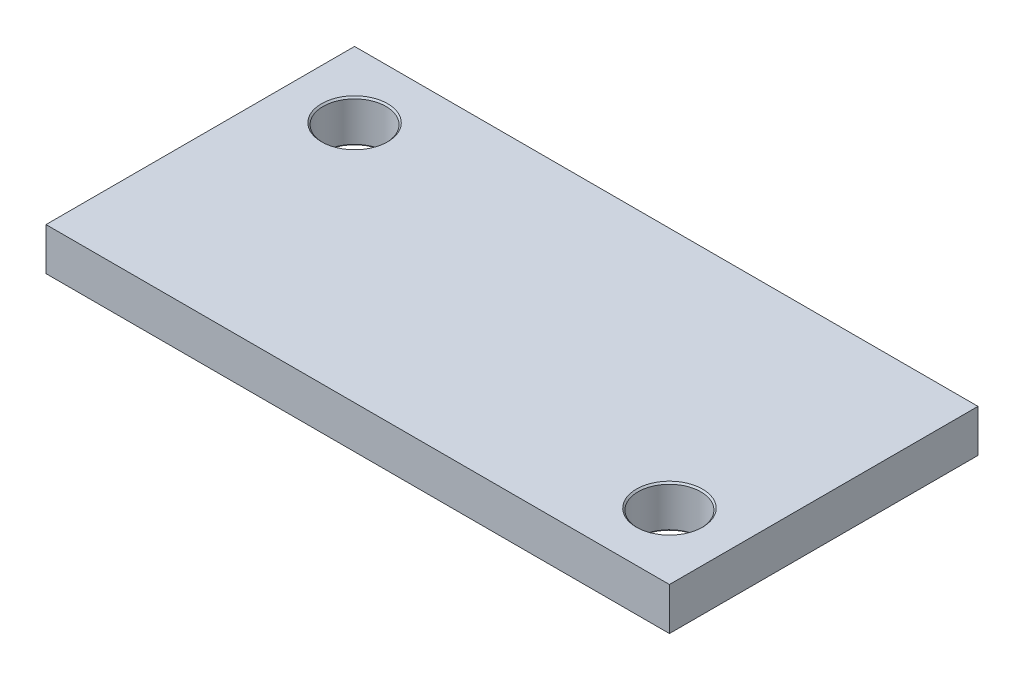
ISO-10303-21;
HEADER;
FILE_DESCRIPTION(('STEP AP214'),'2;1');
FILE_NAME('part.step','',(''),(''),'','','');
FILE_SCHEMA(('AUTOMOTIVE_DESIGN { 1 0 10303 214 1 1 1 1 }'));
ENDSEC;
DATA;
#1=APPLICATION_CONTEXT('core data for automotive mechanical design processes');
#2=APPLICATION_PROTOCOL_DEFINITION('international standard','automotive_design',2000,#1);
#3=PRODUCT_CONTEXT('',#1,'mechanical');
#4=PRODUCT('Part','Part','',(#3));
#5=PRODUCT_RELATED_PRODUCT_CATEGORY('part','',(#4));
#6=PRODUCT_DEFINITION_FORMATION('','',#4);
#7=PRODUCT_DEFINITION_CONTEXT('part definition',#1,'design');
#8=PRODUCT_DEFINITION('design','',#6,#7);
#9=PRODUCT_DEFINITION_SHAPE('','',#8);
#10=(LENGTH_UNIT() NAMED_UNIT(*) SI_UNIT(.MILLI.,.METRE.));
#11=(NAMED_UNIT(*) PLANE_ANGLE_UNIT() SI_UNIT($,.RADIAN.));
#12=(NAMED_UNIT(*) SI_UNIT($,.STERADIAN.) SOLID_ANGLE_UNIT());
#13=UNCERTAINTY_MEASURE_WITH_UNIT(LENGTH_MEASURE(1.E-05),#10,'distance_accuracy_value','');
#14=(GEOMETRIC_REPRESENTATION_CONTEXT(3) GLOBAL_UNCERTAINTY_ASSIGNED_CONTEXT((#13)) GLOBAL_UNIT_ASSIGNED_CONTEXT((#10,
#11,#12)) REPRESENTATION_CONTEXT('',''));
#15=CARTESIAN_POINT('',(0.,0.,0.));
#16=DIRECTION('',(0.,0.,1.));
#17=DIRECTION('',(1.,0.,0.));
#18=AXIS2_PLACEMENT_3D('',#15,#16,#17);
#19=CARTESIAN_POINT('',(0.,27.,0.));
#20=DIRECTION('',(0.,1.,0.));
#21=DIRECTION('',(0.,0.,1.));
#22=AXIS2_PLACEMENT_3D('',#19,#20,#21);
#23=PLANE('',#22);
#24=CARTESIAN_POINT('',(156.,27.,56.));
#25=DIRECTION('',(0.,1.,0.));
#26=DIRECTION('',(0.,0.,1.));
#27=AXIS2_PLACEMENT_3D('',#24,#25,#26);
#28=CIRCLE('',#27,21.);
#29=CARTESIAN_POINT('',(156.,27.,77.));
#30=VERTEX_POINT('',#29);
#31=EDGE_CURVE('E172',#30,#30,#28,.F.);
#32=ORIENTED_EDGE('',*,*,#31,.T.);
#33=EDGE_LOOP('',(#32));
#34=FACE_BOUND('',#33,.T.);
#35=CARTESIAN_POINT('',(-156.,27.,-56.));
#36=DIRECTION('',(0.,1.,0.));
#37=DIRECTION('',(0.,0.,1.));
#38=AXIS2_PLACEMENT_3D('',#35,#36,#37);
#39=CIRCLE('',#38,21.);
#40=CARTESIAN_POINT('',(-156.,27.,-35.));
#41=VERTEX_POINT('',#40);
#42=EDGE_CURVE('E169',#41,#41,#39,.F.);
#43=ORIENTED_EDGE('',*,*,#42,.T.);
#44=EDGE_LOOP('',(#43));
#45=FACE_BOUND('',#44,.T.);
#46=DIRECTION('',(0.,0.,1.));
#47=VECTOR('',#46,1.);
#48=CARTESIAN_POINT('',(-198.,27.,98.));
#49=LINE('',#48,#47);
#50=CARTESIAN_POINT('',(-198.,27.,-98.));
#51=VERTEX_POINT('',#50);
#52=CARTESIAN_POINT('',(-198.,27.,98.));
#53=VERTEX_POINT('',#52);
#54=EDGE_CURVE('E119',#51,#53,#49,.T.);
#55=ORIENTED_EDGE('',*,*,#54,.T.);
#56=DIRECTION('',(1.,0.,0.));
#57=VECTOR('',#56,1.);
#58=CARTESIAN_POINT('',(198.,27.,98.));
#59=LINE('',#58,#57);
#60=CARTESIAN_POINT('',(198.,27.,98.));
#61=VERTEX_POINT('',#60);
#62=EDGE_CURVE('E67',#53,#61,#59,.T.);
#63=ORIENTED_EDGE('',*,*,#62,.T.);
#64=DIRECTION('',(0.,0.,-1.));
#65=VECTOR('',#64,1.);
#66=CARTESIAN_POINT('',(198.,27.,98.));
#67=LINE('',#66,#65);
#68=CARTESIAN_POINT('',(198.,27.,-98.));
#69=VERTEX_POINT('',#68);
#70=EDGE_CURVE('E122',#61,#69,#67,.T.);
#71=ORIENTED_EDGE('',*,*,#70,.T.);
#72=DIRECTION('',(-1.,0.,0.));
#73=VECTOR('',#72,1.);
#74=CARTESIAN_POINT('',(198.,27.,-98.));
#75=LINE('',#74,#73);
#76=EDGE_CURVE('E35',#69,#51,#75,.T.);
#77=ORIENTED_EDGE('',*,*,#76,.T.);
#78=EDGE_LOOP('',(#55,#63,#71,#77));
#79=FACE_BOUND('',#78,.T.);
#80=ADVANCED_FACE('F16',(#34,#45,#79),#23,.T.);
#81=CARTESIAN_POINT('',(0.,0.,0.));
#82=DIRECTION('',(0.,1.,0.));
#83=DIRECTION('',(0.,0.,1.));
#84=AXIS2_PLACEMENT_3D('',#81,#82,#83);
#85=PLANE('',#84);
#86=CARTESIAN_POINT('',(156.,0.,56.));
#87=DIRECTION('',(0.,1.,0.));
#88=DIRECTION('',(0.,0.,1.));
#89=AXIS2_PLACEMENT_3D('',#86,#87,#88);
#90=CIRCLE('',#89,21.);
#91=CARTESIAN_POINT('',(156.,0.,77.));
#92=VERTEX_POINT('',#91);
#93=EDGE_CURVE('E160',#92,#92,#90,.T.);
#94=ORIENTED_EDGE('',*,*,#93,.T.);
#95=EDGE_LOOP('',(#94));
#96=FACE_BOUND('',#95,.T.);
#97=CARTESIAN_POINT('',(-156.,0.,-56.));
#98=DIRECTION('',(0.,1.,0.));
#99=DIRECTION('',(0.,0.,1.));
#100=AXIS2_PLACEMENT_3D('',#97,#98,#99);
#101=CIRCLE('',#100,21.);
#102=CARTESIAN_POINT('',(-156.,0.,-35.));
#103=VERTEX_POINT('',#102);
#104=EDGE_CURVE('E157',#103,#103,#101,.T.);
#105=ORIENTED_EDGE('',*,*,#104,.T.);
#106=EDGE_LOOP('',(#105));
#107=FACE_BOUND('',#106,.T.);
#108=CARTESIAN_POINT('',(181.980762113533,0.,41.));
#109=DIRECTION('',(0.,1.,0.));
#110=DIRECTION('',(0.,0.,1.));
#111=AXIS2_PLACEMENT_3D('',#108,#109,#110);
#112=CIRCLE('',#111,3.49999999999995);
#113=CARTESIAN_POINT('',(181.980762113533,0.,44.5));
#114=VERTEX_POINT('',#113);
#115=EDGE_CURVE('E154',#114,#114,#112,.T.);
#116=ORIENTED_EDGE('',*,*,#115,.T.);
#117=EDGE_LOOP('',(#116));
#118=FACE_BOUND('',#117,.T.);
#119=CARTESIAN_POINT('',(130.019237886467,0.,41.));
#120=DIRECTION('',(0.,1.,0.));
#121=DIRECTION('',(0.,0.,1.));
#122=AXIS2_PLACEMENT_3D('',#119,#120,#121);
#123=CIRCLE('',#122,3.49999999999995);
#124=CARTESIAN_POINT('',(130.019237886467,0.,44.5));
#125=VERTEX_POINT('',#124);
#126=EDGE_CURVE('E151',#125,#125,#123,.T.);
#127=ORIENTED_EDGE('',*,*,#126,.T.);
#128=EDGE_LOOP('',(#127));
#129=FACE_BOUND('',#128,.T.);
#130=CARTESIAN_POINT('',(156.,0.,86.));
#131=DIRECTION('',(0.,1.,0.));
#132=DIRECTION('',(0.,0.,1.));
#133=AXIS2_PLACEMENT_3D('',#130,#131,#132);
#134=CIRCLE('',#133,3.49999999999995);
#135=CARTESIAN_POINT('',(156.,0.,89.4999999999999));
#136=VERTEX_POINT('',#135);
#137=EDGE_CURVE('E148',#136,#136,#134,.T.);
#138=ORIENTED_EDGE('',*,*,#137,.T.);
#139=EDGE_LOOP('',(#138));
#140=FACE_BOUND('',#139,.T.);
#141=CARTESIAN_POINT('',(-130.019237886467,0.,-41.));
#142=DIRECTION('',(0.,1.,0.));
#143=DIRECTION('',(0.,0.,1.));
#144=AXIS2_PLACEMENT_3D('',#141,#142,#143);
#145=CIRCLE('',#144,3.50000000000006);
#146=CARTESIAN_POINT('',(-130.019237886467,0.,-37.4999999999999));
#147=VERTEX_POINT('',#146);
#148=EDGE_CURVE('E145',#147,#147,#145,.T.);
#149=ORIENTED_EDGE('',*,*,#148,.T.);
#150=EDGE_LOOP('',(#149));
#151=FACE_BOUND('',#150,.T.);
#152=CARTESIAN_POINT('',(-156.,0.,-86.));
#153=DIRECTION('',(0.,1.,0.));
#154=DIRECTION('',(0.,0.,1.));
#155=AXIS2_PLACEMENT_3D('',#152,#153,#154);
#156=CIRCLE('',#155,3.49999999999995);
#157=CARTESIAN_POINT('',(-156.,0.,-82.5));
#158=VERTEX_POINT('',#157);
#159=EDGE_CURVE('E142',#158,#158,#156,.T.);
#160=ORIENTED_EDGE('',*,*,#159,.T.);
#161=EDGE_LOOP('',(#160));
#162=FACE_BOUND('',#161,.T.);
#163=CARTESIAN_POINT('',(-181.980762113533,0.,-41.));
#164=DIRECTION('',(0.,1.,0.));
#165=DIRECTION('',(0.,0.,1.));
#166=AXIS2_PLACEMENT_3D('',#163,#164,#165);
#167=CIRCLE('',#166,3.49999999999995);
#168=CARTESIAN_POINT('',(-181.980762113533,0.,-37.5000000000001));
#169=VERTEX_POINT('',#168);
#170=EDGE_CURVE('E139',#169,#169,#167,.T.);
#171=ORIENTED_EDGE('',*,*,#170,.T.);
#172=EDGE_LOOP('',(#171));
#173=FACE_BOUND('',#172,.T.);
#174=DIRECTION('',(0.,0.,1.));
#175=VECTOR('',#174,1.);
#176=CARTESIAN_POINT('',(-198.,0.,98.));
#177=LINE('',#176,#175);
#178=CARTESIAN_POINT('',(-198.,0.,-98.));
#179=VERTEX_POINT('',#178);
#180=CARTESIAN_POINT('',(-198.,0.,98.));
#181=VERTEX_POINT('',#180);
#182=EDGE_CURVE('E118',#179,#181,#177,.T.);
#183=ORIENTED_EDGE('',*,*,#182,.F.);
#184=DIRECTION('',(-1.,0.,0.));
#185=VECTOR('',#184,1.);
#186=CARTESIAN_POINT('',(198.,0.,-98.));
#187=LINE('',#186,#185);
#188=CARTESIAN_POINT('',(198.,0.,-98.));
#189=VERTEX_POINT('',#188);
#190=EDGE_CURVE('E59',#189,#179,#187,.T.);
#191=ORIENTED_EDGE('',*,*,#190,.F.);
#192=DIRECTION('',(0.,0.,-1.));
#193=VECTOR('',#192,1.);
#194=CARTESIAN_POINT('',(198.,0.,98.));
#195=LINE('',#194,#193);
#196=CARTESIAN_POINT('',(198.,0.,98.));
#197=VERTEX_POINT('',#196);
#198=EDGE_CURVE('E53',#197,#189,#195,.T.);
#199=ORIENTED_EDGE('',*,*,#198,.F.);
#200=DIRECTION('',(1.,0.,0.));
#201=VECTOR('',#200,1.);
#202=CARTESIAN_POINT('',(198.,0.,98.));
#203=LINE('',#202,#201);
#204=EDGE_CURVE('E128',#181,#197,#203,.T.);
#205=ORIENTED_EDGE('',*,*,#204,.F.);
#206=EDGE_LOOP('',(#183,#191,#199,#205));
#207=FACE_BOUND('',#206,.T.);
#208=ADVANCED_FACE('F232',(#96,#107,#118,#129,#140,#151,#162,#173,#207),#85,.F.);
#209=CARTESIAN_POINT('',(-198.,27.,98.));
#210=DIRECTION('',(1.,0.,0.));
#211=DIRECTION('',(0.,0.,-1.));
#212=AXIS2_PLACEMENT_3D('',#209,#210,#211);
#213=PLANE('',#212);
#214=ORIENTED_EDGE('',*,*,#182,.T.);
#215=DIRECTION('',(0.,-1.,0.));
#216=VECTOR('',#215,1.);
#217=CARTESIAN_POINT('',(-198.,27.,98.));
#218=LINE('',#217,#216);
#219=EDGE_CURVE('E137',#53,#181,#218,.T.);
#220=ORIENTED_EDGE('',*,*,#219,.F.);
#221=ORIENTED_EDGE('',*,*,#54,.F.);
#222=DIRECTION('',(0.,-1.,0.));
#223=VECTOR('',#222,1.);
#224=CARTESIAN_POINT('',(-198.,27.,-98.));
#225=LINE('',#224,#223);
#226=EDGE_CURVE('E125',#51,#179,#225,.T.);
#227=ORIENTED_EDGE('',*,*,#226,.T.);
#228=EDGE_LOOP('',(#214,#220,#221,#227));
#229=FACE_BOUND('',#228,.T.);
#230=ADVANCED_FACE('F239',(#229),#213,.F.);
#231=CARTESIAN_POINT('',(198.,27.,98.));
#232=DIRECTION('',(0.,0.,-1.));
#233=DIRECTION('',(-1.,0.,0.));
#234=AXIS2_PLACEMENT_3D('',#231,#232,#233);
#235=PLANE('',#234);
#236=ORIENTED_EDGE('',*,*,#204,.T.);
#237=DIRECTION('',(0.,-1.,0.));
#238=VECTOR('',#237,1.);
#239=CARTESIAN_POINT('',(198.,27.,98.));
#240=LINE('',#239,#238);
#241=EDGE_CURVE('E135',#61,#197,#240,.T.);
#242=ORIENTED_EDGE('',*,*,#241,.F.);
#243=ORIENTED_EDGE('',*,*,#62,.F.);
#244=ORIENTED_EDGE('',*,*,#219,.T.);
#245=EDGE_LOOP('',(#236,#242,#243,#244));
#246=FACE_BOUND('',#245,.T.);
#247=ADVANCED_FACE('F253',(#246),#235,.F.);
#248=CARTESIAN_POINT('',(198.,27.,98.));
#249=DIRECTION('',(-1.,0.,0.));
#250=DIRECTION('',(0.,0.,1.));
#251=AXIS2_PLACEMENT_3D('',#248,#249,#250);
#252=PLANE('',#251);
#253=ORIENTED_EDGE('',*,*,#198,.T.);
#254=DIRECTION('',(0.,-1.,0.));
#255=VECTOR('',#254,1.);
#256=CARTESIAN_POINT('',(198.,27.,-98.));
#257=LINE('',#256,#255);
#258=EDGE_CURVE('E133',#69,#189,#257,.T.);
#259=ORIENTED_EDGE('',*,*,#258,.F.);
#260=ORIENTED_EDGE('',*,*,#70,.F.);
#261=ORIENTED_EDGE('',*,*,#241,.T.);
#262=EDGE_LOOP('',(#253,#259,#260,#261));
#263=FACE_BOUND('',#262,.T.);
#264=ADVANCED_FACE('F250',(#263),#252,.F.);
#265=CARTESIAN_POINT('',(198.,27.,-98.));
#266=DIRECTION('',(0.,0.,1.));
#267=DIRECTION('',(1.,0.,0.));
#268=AXIS2_PLACEMENT_3D('',#265,#266,#267);
#269=PLANE('',#268);
#270=ORIENTED_EDGE('',*,*,#190,.T.);
#271=ORIENTED_EDGE('',*,*,#226,.F.);
#272=ORIENTED_EDGE('',*,*,#76,.F.);
#273=ORIENTED_EDGE('',*,*,#258,.T.);
#274=EDGE_LOOP('',(#270,#271,#272,#273));
#275=FACE_BOUND('',#274,.T.);
#276=ADVANCED_FACE('F247',(#275),#269,.F.);
#277=CARTESIAN_POINT('',(-156.,27.,-56.));
#278=DIRECTION('',(0.,-1.,0.));
#279=DIRECTION('',(0.,0.,-1.));
#280=AXIS2_PLACEMENT_3D('',#277,#278,#279);
#281=CYLINDRICAL_SURFACE('',#280,20.);
#282=CARTESIAN_POINT('',(-156.,1.00000000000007,-56.));
#283=DIRECTION('',(0.,1.,0.));
#284=DIRECTION('',(0.,0.,1.));
#285=AXIS2_PLACEMENT_3D('',#282,#283,#284);
#286=CIRCLE('',#285,20.);
#287=CARTESIAN_POINT('',(-156.,1.00000000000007,-36.));
#288=VERTEX_POINT('',#287);
#289=EDGE_CURVE('E10',#288,#288,#286,.F.);
#290=ORIENTED_EDGE('',*,*,#289,.T.);
#291=EDGE_LOOP('',(#290));
#292=FACE_BOUND('',#291,.T.);
#293=CARTESIAN_POINT('',(-156.,26.,-56.));
#294=DIRECTION('',(0.,1.,0.));
#295=DIRECTION('',(0.,0.,1.));
#296=AXIS2_PLACEMENT_3D('',#293,#294,#295);
#297=CIRCLE('',#296,20.);
#298=CARTESIAN_POINT('',(-156.,26.,-36.));
#299=VERTEX_POINT('',#298);
#300=EDGE_CURVE('E26',#299,#299,#297,.T.);
#301=ORIENTED_EDGE('',*,*,#300,.T.);
#302=EDGE_LOOP('',(#301));
#303=FACE_BOUND('',#302,.T.);
#304=ADVANCED_FACE('F244',(#292,#303),#281,.F.);
#305=CARTESIAN_POINT('',(156.,27.,56.));
#306=DIRECTION('',(0.,-1.,0.));
#307=DIRECTION('',(0.,0.,-1.));
#308=AXIS2_PLACEMENT_3D('',#305,#306,#307);
#309=CYLINDRICAL_SURFACE('',#308,20.);
#310=CARTESIAN_POINT('',(156.,1.00000000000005,56.));
#311=DIRECTION('',(0.,1.,0.));
#312=DIRECTION('',(0.,0.,1.));
#313=AXIS2_PLACEMENT_3D('',#310,#311,#312);
#314=CIRCLE('',#313,20.);
#315=CARTESIAN_POINT('',(156.,1.00000000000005,76.));
#316=VERTEX_POINT('',#315);
#317=EDGE_CURVE('E166',#316,#316,#314,.F.);
#318=ORIENTED_EDGE('',*,*,#317,.T.);
#319=EDGE_LOOP('',(#318));
#320=FACE_BOUND('',#319,.T.);
#321=CARTESIAN_POINT('',(156.,26.,56.));
#322=DIRECTION('',(0.,1.,0.));
#323=DIRECTION('',(0.,0.,1.));
#324=AXIS2_PLACEMENT_3D('',#321,#322,#323);
#325=CIRCLE('',#324,20.);
#326=CARTESIAN_POINT('',(156.,26.,76.));
#327=VERTEX_POINT('',#326);
#328=EDGE_CURVE('E163',#327,#327,#325,.T.);
#329=ORIENTED_EDGE('',*,*,#328,.T.);
#330=EDGE_LOOP('',(#329));
#331=FACE_BOUND('',#330,.T.);
#332=ADVANCED_FACE('F263',(#320,#331),#309,.F.);
#333=CARTESIAN_POINT('',(156.,0.,56.));
#334=DIRECTION('',(0.,-1.,0.));
#335=DIRECTION('',(0.,0.,-1.));
#336=AXIS2_PLACEMENT_3D('',#333,#334,#335);
#337=CONICAL_SURFACE('',#336,21.,0.785398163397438);
#338=ORIENTED_EDGE('',*,*,#317,.F.);
#339=EDGE_LOOP('',(#338));
#340=FACE_BOUND('',#339,.T.);
#341=ORIENTED_EDGE('',*,*,#93,.F.);
#342=EDGE_LOOP('',(#341));
#343=FACE_BOUND('',#342,.T.);
#344=ADVANCED_FACE('F259',(#340,#343),#337,.F.);
#345=CARTESIAN_POINT('',(156.,26.,56.));
#346=DIRECTION('',(0.,1.,0.));
#347=DIRECTION('',(0.,0.,1.));
#348=AXIS2_PLACEMENT_3D('',#345,#346,#347);
#349=CONICAL_SURFACE('',#348,20.,0.785398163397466);
#350=ORIENTED_EDGE('',*,*,#31,.F.);
#351=EDGE_LOOP('',(#350));
#352=FACE_BOUND('',#351,.T.);
#353=ORIENTED_EDGE('',*,*,#328,.F.);
#354=EDGE_LOOP('',(#353));
#355=FACE_BOUND('',#354,.T.);
#356=ADVANCED_FACE('F262',(#352,#355),#349,.F.);
#357=CARTESIAN_POINT('',(-156.,0.,-56.));
#358=DIRECTION('',(0.,-1.,0.));
#359=DIRECTION('',(0.,0.,-1.));
#360=AXIS2_PLACEMENT_3D('',#357,#358,#359);
#361=CONICAL_SURFACE('',#360,21.,0.785398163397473);
#362=ORIENTED_EDGE('',*,*,#289,.F.);
#363=EDGE_LOOP('',(#362));
#364=FACE_BOUND('',#363,.T.);
#365=ORIENTED_EDGE('',*,*,#104,.F.);
#366=EDGE_LOOP('',(#365));
#367=FACE_BOUND('',#366,.T.);
#368=ADVANCED_FACE('F267',(#364,#367),#361,.F.);
#369=CARTESIAN_POINT('',(-156.,26.,-56.));
#370=DIRECTION('',(0.,1.,0.));
#371=DIRECTION('',(0.,0.,1.));
#372=AXIS2_PLACEMENT_3D('',#369,#370,#371);
#373=CONICAL_SURFACE('',#372,20.,0.785398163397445);
#374=ORIENTED_EDGE('',*,*,#42,.F.);
#375=EDGE_LOOP('',(#374));
#376=FACE_BOUND('',#375,.T.);
#377=ORIENTED_EDGE('',*,*,#300,.F.);
#378=EDGE_LOOP('',(#377));
#379=FACE_BOUND('',#378,.T.);
#380=ADVANCED_FACE('F271',(#376,#379),#373,.F.);
#381=CARTESIAN_POINT('',(181.980762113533,1.00000000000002,41.));
#382=DIRECTION('',(0.,-1.,0.));
#383=DIRECTION('',(0.,0.,-1.));
#384=AXIS2_PLACEMENT_3D('',#381,#382,#383);
#385=CONICAL_SURFACE('',#384,2.5,0.785398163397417);
#386=CARTESIAN_POINT('',(181.980762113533,0.499999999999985,41.));
#387=DIRECTION('',(0.,-1.,0.));
#388=DIRECTION('',(0.,0.,-1.));
#389=AXIS2_PLACEMENT_3D('',#386,#387,#388);
#390=CIRCLE('',#389,3.);
#391=CARTESIAN_POINT('',(181.980762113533,0.499999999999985,38.));
#392=VERTEX_POINT('',#391);
#393=EDGE_CURVE('E192',#392,#392,#390,.T.);
#394=ORIENTED_EDGE('',*,*,#393,.F.);
#395=EDGE_LOOP('',(#394));
#396=FACE_BOUND('',#395,.T.);
#397=ORIENTED_EDGE('',*,*,#115,.F.);
#398=EDGE_LOOP('',(#397));
#399=FACE_BOUND('',#398,.T.);
#400=ADVANCED_FACE('F275',(#396,#399),#385,.F.);
#401=CARTESIAN_POINT('',(130.019237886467,1.00000000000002,41.));
#402=DIRECTION('',(0.,-1.,0.));
#403=DIRECTION('',(0.,0.,-1.));
#404=AXIS2_PLACEMENT_3D('',#401,#402,#403);
#405=CONICAL_SURFACE('',#404,2.5,0.785398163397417);
#406=CARTESIAN_POINT('',(130.019237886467,0.499999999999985,41.));
#407=DIRECTION('',(0.,-1.,0.));
#408=DIRECTION('',(0.,0.,-1.));
#409=AXIS2_PLACEMENT_3D('',#406,#407,#408);
#410=CIRCLE('',#409,3.);
#411=CARTESIAN_POINT('',(130.019237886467,0.499999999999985,38.));
#412=VERTEX_POINT('',#411);
#413=EDGE_CURVE('E189',#412,#412,#410,.T.);
#414=ORIENTED_EDGE('',*,*,#413,.F.);
#415=EDGE_LOOP('',(#414));
#416=FACE_BOUND('',#415,.T.);
#417=ORIENTED_EDGE('',*,*,#126,.F.);
#418=EDGE_LOOP('',(#417));
#419=FACE_BOUND('',#418,.T.);
#420=ADVANCED_FACE('F279',(#416,#419),#405,.F.);
#421=CARTESIAN_POINT('',(156.,1.00000000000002,86.));
#422=DIRECTION('',(0.,-1.,0.));
#423=DIRECTION('',(0.,0.,-1.));
#424=AXIS2_PLACEMENT_3D('',#421,#422,#423);
#425=CONICAL_SURFACE('',#424,2.5,0.785398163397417);
#426=CARTESIAN_POINT('',(156.,0.499999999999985,86.));
#427=DIRECTION('',(0.,-1.,0.));
#428=DIRECTION('',(0.,0.,-1.));
#429=AXIS2_PLACEMENT_3D('',#426,#427,#428);
#430=CIRCLE('',#429,3.);
#431=CARTESIAN_POINT('',(156.,0.499999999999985,83.));
#432=VERTEX_POINT('',#431);
#433=EDGE_CURVE('E186',#432,#432,#430,.T.);
#434=ORIENTED_EDGE('',*,*,#433,.F.);
#435=EDGE_LOOP('',(#434));
#436=FACE_BOUND('',#435,.T.);
#437=ORIENTED_EDGE('',*,*,#137,.F.);
#438=EDGE_LOOP('',(#437));
#439=FACE_BOUND('',#438,.T.);
#440=ADVANCED_FACE('F283',(#436,#439),#425,.F.);
#441=CARTESIAN_POINT('',(-130.019237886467,1.00000000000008,-41.));
#442=DIRECTION('',(0.,-1.,0.));
#443=DIRECTION('',(0.,0.,-1.));
#444=AXIS2_PLACEMENT_3D('',#441,#442,#443);
#445=CONICAL_SURFACE('',#444,2.5,0.785398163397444);
#446=CARTESIAN_POINT('',(-130.019237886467,0.500000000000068,-41.));
#447=DIRECTION('',(0.,-1.,0.));
#448=DIRECTION('',(0.,0.,-1.));
#449=AXIS2_PLACEMENT_3D('',#446,#447,#448);
#450=CIRCLE('',#449,3.);
#451=CARTESIAN_POINT('',(-130.019237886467,0.500000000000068,-44.));
#452=VERTEX_POINT('',#451);
#453=EDGE_CURVE('E183',#452,#452,#450,.T.);
#454=ORIENTED_EDGE('',*,*,#453,.F.);
#455=EDGE_LOOP('',(#454));
#456=FACE_BOUND('',#455,.T.);
#457=ORIENTED_EDGE('',*,*,#148,.F.);
#458=EDGE_LOOP('',(#457));
#459=FACE_BOUND('',#458,.T.);
#460=ADVANCED_FACE('F287',(#456,#459),#445,.F.);
#461=CARTESIAN_POINT('',(-156.,1.00000000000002,-86.));
#462=DIRECTION('',(0.,-1.,0.));
#463=DIRECTION('',(0.,0.,-1.));
#464=AXIS2_PLACEMENT_3D('',#461,#462,#463);
#465=CONICAL_SURFACE('',#464,2.5,0.785398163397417);
#466=CARTESIAN_POINT('',(-156.,0.499999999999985,-86.));
#467=DIRECTION('',(0.,-1.,0.));
#468=DIRECTION('',(0.,0.,-1.));
#469=AXIS2_PLACEMENT_3D('',#466,#467,#468);
#470=CIRCLE('',#469,3.);
#471=CARTESIAN_POINT('',(-156.,0.499999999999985,-89.));
#472=VERTEX_POINT('',#471);
#473=EDGE_CURVE('E180',#472,#472,#470,.T.);
#474=ORIENTED_EDGE('',*,*,#473,.F.);
#475=EDGE_LOOP('',(#474));
#476=FACE_BOUND('',#475,.T.);
#477=ORIENTED_EDGE('',*,*,#159,.F.);
#478=EDGE_LOOP('',(#477));
#479=FACE_BOUND('',#478,.T.);
#480=ADVANCED_FACE('F290',(#476,#479),#465,.F.);
#481=CARTESIAN_POINT('',(-181.980762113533,1.00000000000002,-41.));
#482=DIRECTION('',(0.,-1.,0.));
#483=DIRECTION('',(0.,0.,-1.));
#484=AXIS2_PLACEMENT_3D('',#481,#482,#483);
#485=CONICAL_SURFACE('',#484,2.5,0.785398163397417);
#486=CARTESIAN_POINT('',(-181.980762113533,0.499999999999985,-41.));
#487=DIRECTION('',(0.,-1.,0.));
#488=DIRECTION('',(0.,0.,-1.));
#489=AXIS2_PLACEMENT_3D('',#486,#487,#488);
#490=CIRCLE('',#489,3.);
#491=CARTESIAN_POINT('',(-181.980762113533,0.499999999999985,-44.));
#492=VERTEX_POINT('',#491);
#493=EDGE_CURVE('E177',#492,#492,#490,.T.);
#494=ORIENTED_EDGE('',*,*,#493,.F.);
#495=EDGE_LOOP('',(#494));
#496=FACE_BOUND('',#495,.T.);
#497=ORIENTED_EDGE('',*,*,#170,.F.);
#498=EDGE_LOOP('',(#497));
#499=FACE_BOUND('',#498,.T.);
#500=ADVANCED_FACE('F18',(#496,#499),#485,.F.);
#501=CARTESIAN_POINT('',(-181.980762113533,15.,-41.));
#502=DIRECTION('',(0.,-1.,0.));
#503=DIRECTION('',(0.,0.,-1.));
#504=AXIS2_PLACEMENT_3D('',#501,#502,#503);
#505=PLANE('',#504);
#506=CARTESIAN_POINT('',(-181.980762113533,15.,-41.));
#507=DIRECTION('',(0.,-1.,0.));
#508=DIRECTION('',(0.,0.,-1.));
#509=AXIS2_PLACEMENT_3D('',#506,#507,#508);
#510=CIRCLE('',#509,3.);
#511=CARTESIAN_POINT('',(-181.980762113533,15.,-44.));
#512=VERTEX_POINT('',#511);
#513=EDGE_CURVE('E330',#512,#512,#510,.T.);
#514=ORIENTED_EDGE('',*,*,#513,.T.);
#515=EDGE_LOOP('',(#514));
#516=FACE_BOUND('',#515,.T.);
#517=CARTESIAN_POINT('',(-181.980762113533,15.,-41.));
#518=DIRECTION('',(0.,-1.,0.));
#519=DIRECTION('',(0.,0.,-1.));
#520=AXIS2_PLACEMENT_3D('',#517,#518,#519);
#521=CIRCLE('',#520,2.5);
#522=CARTESIAN_POINT('',(-181.980762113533,15.,-43.5));
#523=VERTEX_POINT('',#522);
#524=EDGE_CURVE('E195',#523,#523,#521,.F.);
#525=ORIENTED_EDGE('',*,*,#524,.T.);
#526=EDGE_LOOP('',(#525));
#527=FACE_BOUND('',#526,.T.);
#528=ADVANCED_FACE('F298',(#516,#527),#505,.T.);
#529=CARTESIAN_POINT('',(-181.980762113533,15.,-41.));
#530=DIRECTION('',(0.,-1.,0.));
#531=DIRECTION('',(0.,0.,-1.));
#532=AXIS2_PLACEMENT_3D('',#529,#530,#531);
#533=CYLINDRICAL_SURFACE('',#532,3.);
#534=ORIENTED_EDGE('',*,*,#493,.T.);
#535=EDGE_LOOP('',(#534));
#536=FACE_BOUND('',#535,.T.);
#537=ORIENTED_EDGE('',*,*,#513,.F.);
#538=EDGE_LOOP('',(#537));
#539=FACE_BOUND('',#538,.T.);
#540=ADVANCED_FACE('F338',(#536,#539),#533,.F.);
#541=CARTESIAN_POINT('',(-156.,15.,-86.));
#542=DIRECTION('',(0.,-1.,0.));
#543=DIRECTION('',(0.,0.,-1.));
#544=AXIS2_PLACEMENT_3D('',#541,#542,#543);
#545=PLANE('',#544);
#546=CARTESIAN_POINT('',(-156.,15.,-86.));
#547=DIRECTION('',(0.,-1.,0.));
#548=DIRECTION('',(0.,0.,-1.));
#549=AXIS2_PLACEMENT_3D('',#546,#547,#548);
#550=CIRCLE('',#549,3.);
#551=CARTESIAN_POINT('',(-156.,15.,-89.));
#552=VERTEX_POINT('',#551);
#553=EDGE_CURVE('E321',#552,#552,#550,.T.);
#554=ORIENTED_EDGE('',*,*,#553,.T.);
#555=EDGE_LOOP('',(#554));
#556=FACE_BOUND('',#555,.T.);
#557=CARTESIAN_POINT('',(-156.,15.,-86.));
#558=DIRECTION('',(0.,-1.,0.));
#559=DIRECTION('',(0.,0.,-1.));
#560=AXIS2_PLACEMENT_3D('',#557,#558,#559);
#561=CIRCLE('',#560,2.5);
#562=CARTESIAN_POINT('',(-156.,15.,-88.5));
#563=VERTEX_POINT('',#562);
#564=EDGE_CURVE('E201',#563,#563,#561,.F.);
#565=ORIENTED_EDGE('',*,*,#564,.T.);
#566=EDGE_LOOP('',(#565));
#567=FACE_BOUND('',#566,.T.);
#568=ADVANCED_FACE('F317',(#556,#567),#545,.T.);
#569=CARTESIAN_POINT('',(-156.,15.,-86.));
#570=DIRECTION('',(0.,-1.,0.));
#571=DIRECTION('',(0.,0.,-1.));
#572=AXIS2_PLACEMENT_3D('',#569,#570,#571);
#573=CYLINDRICAL_SURFACE('',#572,3.);
#574=ORIENTED_EDGE('',*,*,#473,.T.);
#575=EDGE_LOOP('',(#574));
#576=FACE_BOUND('',#575,.T.);
#577=ORIENTED_EDGE('',*,*,#553,.F.);
#578=EDGE_LOOP('',(#577));
#579=FACE_BOUND('',#578,.T.);
#580=ADVANCED_FACE('F313',(#576,#579),#573,.F.);
#581=CARTESIAN_POINT('',(-130.019237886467,15.,-41.));
#582=DIRECTION('',(0.,-1.,0.));
#583=DIRECTION('',(0.,0.,-1.));
#584=AXIS2_PLACEMENT_3D('',#581,#582,#583);
#585=PLANE('',#584);
#586=CARTESIAN_POINT('',(-130.019237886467,15.,-41.));
#587=DIRECTION('',(0.,-1.,0.));
#588=DIRECTION('',(0.,0.,-1.));
#589=AXIS2_PLACEMENT_3D('',#586,#587,#588);
#590=CIRCLE('',#589,3.);
#591=CARTESIAN_POINT('',(-130.019237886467,15.,-44.));
#592=VERTEX_POINT('',#591);
#593=EDGE_CURVE('E324',#592,#592,#590,.T.);
#594=ORIENTED_EDGE('',*,*,#593,.T.);
#595=EDGE_LOOP('',(#594));
#596=FACE_BOUND('',#595,.T.);
#597=CARTESIAN_POINT('',(-130.019237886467,15.,-41.));
#598=DIRECTION('',(0.,-1.,0.));
#599=DIRECTION('',(0.,0.,-1.));
#600=AXIS2_PLACEMENT_3D('',#597,#598,#599);
#601=CIRCLE('',#600,2.5);
#602=CARTESIAN_POINT('',(-130.019237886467,15.,-43.5));
#603=VERTEX_POINT('',#602);
#604=EDGE_CURVE('E198',#603,#603,#601,.F.);
#605=ORIENTED_EDGE('',*,*,#604,.T.);
#606=EDGE_LOOP('',(#605));
#607=FACE_BOUND('',#606,.T.);
#608=ADVANCED_FACE('F316',(#596,#607),#585,.T.);
#609=CARTESIAN_POINT('',(-130.019237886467,15.,-41.));
#610=DIRECTION('',(0.,-1.,0.));
#611=DIRECTION('',(0.,0.,-1.));
#612=AXIS2_PLACEMENT_3D('',#609,#610,#611);
#613=CYLINDRICAL_SURFACE('',#612,3.);
#614=ORIENTED_EDGE('',*,*,#453,.T.);
#615=EDGE_LOOP('',(#614));
#616=FACE_BOUND('',#615,.T.);
#617=ORIENTED_EDGE('',*,*,#593,.F.);
#618=EDGE_LOOP('',(#617));
#619=FACE_BOUND('',#618,.T.);
#620=ADVANCED_FACE('F615',(#616,#619),#613,.F.);
#621=CARTESIAN_POINT('',(156.,15.,86.));
#622=DIRECTION('',(0.,-1.,0.));
#623=DIRECTION('',(0.,0.,-1.));
#624=AXIS2_PLACEMENT_3D('',#621,#622,#623);
#625=PLANE('',#624);
#626=CARTESIAN_POINT('',(156.,15.,86.));
#627=DIRECTION('',(0.,-1.,0.));
#628=DIRECTION('',(0.,0.,-1.));
#629=AXIS2_PLACEMENT_3D('',#626,#627,#628);
#630=CIRCLE('',#629,3.);
#631=CARTESIAN_POINT('',(156.,15.,83.));
#632=VERTEX_POINT('',#631);
#633=EDGE_CURVE('E323',#632,#632,#630,.T.);
#634=ORIENTED_EDGE('',*,*,#633,.T.);
#635=EDGE_LOOP('',(#634));
#636=FACE_BOUND('',#635,.T.);
#637=CARTESIAN_POINT('',(156.,15.,86.));
#638=DIRECTION('',(0.,-1.,0.));
#639=DIRECTION('',(0.,0.,-1.));
#640=AXIS2_PLACEMENT_3D('',#637,#638,#639);
#641=CIRCLE('',#640,2.5);
#642=CARTESIAN_POINT('',(156.,15.,83.5));
#643=VERTEX_POINT('',#642);
#644=EDGE_CURVE('E20',#643,#643,#641,.F.);
#645=ORIENTED_EDGE('',*,*,#644,.T.);
#646=EDGE_LOOP('',(#645));
#647=FACE_BOUND('',#646,.T.);
#648=ADVANCED_FACE('F605',(#636,#647),#625,.T.);
#649=CARTESIAN_POINT('',(156.,15.,86.));
#650=DIRECTION('',(0.,-1.,0.));
#651=DIRECTION('',(0.,0.,-1.));
#652=AXIS2_PLACEMENT_3D('',#649,#650,#651);
#653=CYLINDRICAL_SURFACE('',#652,3.);
#654=ORIENTED_EDGE('',*,*,#433,.T.);
#655=EDGE_LOOP('',(#654));
#656=FACE_BOUND('',#655,.T.);
#657=ORIENTED_EDGE('',*,*,#633,.F.);
#658=EDGE_LOOP('',(#657));
#659=FACE_BOUND('',#658,.T.);
#660=ADVANCED_FACE('F355',(#656,#659),#653,.F.);
#661=CARTESIAN_POINT('',(130.019237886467,15.,41.));
#662=DIRECTION('',(0.,-1.,0.));
#663=DIRECTION('',(0.,0.,-1.));
#664=AXIS2_PLACEMENT_3D('',#661,#662,#663);
#665=PLANE('',#664);
#666=CARTESIAN_POINT('',(130.019237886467,15.,41.));
#667=DIRECTION('',(0.,-1.,0.));
#668=DIRECTION('',(0.,0.,-1.));
#669=AXIS2_PLACEMENT_3D('',#666,#667,#668);
#670=CIRCLE('',#669,3.);
#671=CARTESIAN_POINT('',(130.019237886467,15.,38.));
#672=VERTEX_POINT('',#671);
#673=EDGE_CURVE('E104',#672,#672,#670,.T.);
#674=ORIENTED_EDGE('',*,*,#673,.T.);
#675=EDGE_LOOP('',(#674));
#676=FACE_BOUND('',#675,.T.);
#677=CARTESIAN_POINT('',(130.019237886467,15.,41.));
#678=DIRECTION('',(0.,-1.,0.));
#679=DIRECTION('',(0.,0.,-1.));
#680=AXIS2_PLACEMENT_3D('',#677,#678,#679);
#681=CIRCLE('',#680,2.5);
#682=CARTESIAN_POINT('',(130.019237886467,15.,38.5));
#683=VERTEX_POINT('',#682);
#684=EDGE_CURVE('E204',#683,#683,#681,.F.);
#685=ORIENTED_EDGE('',*,*,#684,.T.);
#686=EDGE_LOOP('',(#685));
#687=FACE_BOUND('',#686,.T.);
#688=ADVANCED_FACE('F351',(#676,#687),#665,.T.);
#689=CARTESIAN_POINT('',(130.019237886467,15.,41.));
#690=DIRECTION('',(0.,-1.,0.));
#691=DIRECTION('',(0.,0.,-1.));
#692=AXIS2_PLACEMENT_3D('',#689,#690,#691);
#693=CYLINDRICAL_SURFACE('',#692,3.);
#694=ORIENTED_EDGE('',*,*,#413,.T.);
#695=EDGE_LOOP('',(#694));
#696=FACE_BOUND('',#695,.T.);
#697=ORIENTED_EDGE('',*,*,#673,.F.);
#698=EDGE_LOOP('',(#697));
#699=FACE_BOUND('',#698,.T.);
#700=ADVANCED_FACE('F354',(#696,#699),#693,.F.);
#701=CARTESIAN_POINT('',(181.980762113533,15.,41.));
#702=DIRECTION('',(0.,-1.,0.));
#703=DIRECTION('',(0.,0.,-1.));
#704=AXIS2_PLACEMENT_3D('',#701,#702,#703);
#705=PLANE('',#704);
#706=CARTESIAN_POINT('',(181.980762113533,15.,41.));
#707=DIRECTION('',(0.,-1.,0.));
#708=DIRECTION('',(0.,0.,-1.));
#709=AXIS2_PLACEMENT_3D('',#706,#707,#708);
#710=CIRCLE('',#709,3.);
#711=CARTESIAN_POINT('',(181.980762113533,15.,38.));
#712=VERTEX_POINT('',#711);
#713=EDGE_CURVE('E327',#712,#712,#710,.T.);
#714=ORIENTED_EDGE('',*,*,#713,.T.);
#715=EDGE_LOOP('',(#714));
#716=FACE_BOUND('',#715,.T.);
#717=CARTESIAN_POINT('',(181.980762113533,15.,41.));
#718=DIRECTION('',(0.,-1.,0.));
#719=DIRECTION('',(0.,0.,-1.));
#720=AXIS2_PLACEMENT_3D('',#717,#718,#719);
#721=CIRCLE('',#720,2.5);
#722=CARTESIAN_POINT('',(181.980762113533,15.,38.5));
#723=VERTEX_POINT('',#722);
#724=EDGE_CURVE('E102',#723,#723,#721,.F.);
#725=ORIENTED_EDGE('',*,*,#724,.T.);
#726=EDGE_LOOP('',(#725));
#727=FACE_BOUND('',#726,.T.);
#728=ADVANCED_FACE('F209',(#716,#727),#705,.T.);
#729=CARTESIAN_POINT('',(181.980762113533,15.,41.));
#730=DIRECTION('',(0.,-1.,0.));
#731=DIRECTION('',(0.,0.,-1.));
#732=AXIS2_PLACEMENT_3D('',#729,#730,#731);
#733=CYLINDRICAL_SURFACE('',#732,3.);
#734=ORIENTED_EDGE('',*,*,#393,.T.);
#735=EDGE_LOOP('',(#734));
#736=FACE_BOUND('',#735,.T.);
#737=ORIENTED_EDGE('',*,*,#713,.F.);
#738=EDGE_LOOP('',(#737));
#739=FACE_BOUND('',#738,.T.);
#740=ADVANCED_FACE('F90',(#736,#739),#733,.F.);
#741=CARTESIAN_POINT('',(-181.980762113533,18.,-41.));
#742=DIRECTION('',(0.,-1.,0.));
#743=DIRECTION('',(0.,0.,-1.));
#744=AXIS2_PLACEMENT_3D('',#741,#742,#743);
#745=CONICAL_SURFACE('',#744,2.49999999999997,1.02974425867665);
#746=CARTESIAN_POINT('',(-181.980762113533,19.5021515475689,-41.));
#747=VERTEX_POINT('',#746);
#748=VERTEX_LOOP('',#747);
#749=FACE_BOUND('',#748,.T.);
#750=CARTESIAN_POINT('',(-181.980762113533,18.,-41.));
#751=DIRECTION('',(0.,-1.,0.));
#752=DIRECTION('',(0.,0.,-1.));
#753=AXIS2_PLACEMENT_3D('',#750,#751,#752);
#754=CIRCLE('',#753,2.49999999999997);
#755=CARTESIAN_POINT('',(-181.980762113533,18.,-43.5));
#756=VERTEX_POINT('',#755);
#757=EDGE_CURVE('E94',#756,#756,#754,.T.);
#758=ORIENTED_EDGE('',*,*,#757,.T.);
#759=EDGE_LOOP('',(#758));
#760=FACE_BOUND('',#759,.T.);
#761=ADVANCED_FACE('F86',(#749,#760),#745,.F.);
#762=CARTESIAN_POINT('',(-181.980762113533,0.,-41.));
#763=DIRECTION('',(0.,-1.,0.));
#764=DIRECTION('',(0.,0.,-1.));
#765=AXIS2_PLACEMENT_3D('',#762,#763,#764);
#766=CYLINDRICAL_SURFACE('',#765,2.5);
#767=ORIENTED_EDGE('',*,*,#757,.F.);
#768=EDGE_LOOP('',(#767));
#769=FACE_BOUND('',#768,.T.);
#770=ORIENTED_EDGE('',*,*,#524,.F.);
#771=EDGE_LOOP('',(#770));
#772=FACE_BOUND('',#771,.T.);
#773=ADVANCED_FACE('F89',(#769,#772),#766,.F.);
#774=CARTESIAN_POINT('',(-130.019237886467,18.,-41.));
#775=DIRECTION('',(0.,-1.,0.));
#776=DIRECTION('',(0.,0.,-1.));
#777=AXIS2_PLACEMENT_3D('',#774,#775,#776);
#778=CONICAL_SURFACE('',#777,2.49999999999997,1.02974425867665);
#779=CARTESIAN_POINT('',(-130.019237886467,19.5021515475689,-41.));
#780=VERTEX_POINT('',#779);
#781=VERTEX_LOOP('',#780);
#782=FACE_BOUND('',#781,.T.);
#783=CARTESIAN_POINT('',(-130.019237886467,18.,-41.));
#784=DIRECTION('',(0.,-1.,0.));
#785=DIRECTION('',(0.,0.,-1.));
#786=AXIS2_PLACEMENT_3D('',#783,#784,#785);
#787=CIRCLE('',#786,2.49999999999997);
#788=CARTESIAN_POINT('',(-130.019237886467,18.,-43.5));
#789=VERTEX_POINT('',#788);
#790=EDGE_CURVE('E96',#789,#789,#787,.T.);
#791=ORIENTED_EDGE('',*,*,#790,.T.);
#792=EDGE_LOOP('',(#791));
#793=FACE_BOUND('',#792,.T.);
#794=ADVANCED_FACE('F361',(#782,#793),#778,.F.);
#795=CARTESIAN_POINT('',(-130.019237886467,0.,-41.));
#796=DIRECTION('',(0.,-1.,0.));
#797=DIRECTION('',(0.,0.,-1.));
#798=AXIS2_PLACEMENT_3D('',#795,#796,#797);
#799=CYLINDRICAL_SURFACE('',#798,2.5);
#800=ORIENTED_EDGE('',*,*,#790,.F.);
#801=EDGE_LOOP('',(#800));
#802=FACE_BOUND('',#801,.T.);
#803=ORIENTED_EDGE('',*,*,#604,.F.);
#804=EDGE_LOOP('',(#803));
#805=FACE_BOUND('',#804,.T.);
#806=ADVANCED_FACE('F363',(#802,#805),#799,.F.);
#807=CARTESIAN_POINT('',(-156.,18.,-86.));
#808=DIRECTION('',(0.,-1.,0.));
#809=DIRECTION('',(0.,0.,-1.));
#810=AXIS2_PLACEMENT_3D('',#807,#808,#809);
#811=CONICAL_SURFACE('',#810,2.49999999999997,1.02974425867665);
#812=CARTESIAN_POINT('',(-156.,19.5021515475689,-86.));
#813=VERTEX_POINT('',#812);
#814=VERTEX_LOOP('',#813);
#815=FACE_BOUND('',#814,.T.);
#816=CARTESIAN_POINT('',(-156.,18.,-86.));
#817=DIRECTION('',(0.,-1.,0.));
#818=DIRECTION('',(0.,0.,-1.));
#819=AXIS2_PLACEMENT_3D('',#816,#817,#818);
#820=CIRCLE('',#819,2.49999999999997);
#821=CARTESIAN_POINT('',(-156.,18.,-88.5));
#822=VERTEX_POINT('',#821);
#823=EDGE_CURVE('E99',#822,#822,#820,.T.);
#824=ORIENTED_EDGE('',*,*,#823,.T.);
#825=EDGE_LOOP('',(#824));
#826=FACE_BOUND('',#825,.T.);
#827=ADVANCED_FACE('F366',(#815,#826),#811,.F.);
#828=CARTESIAN_POINT('',(-156.,0.,-86.));
#829=DIRECTION('',(0.,-1.,0.));
#830=DIRECTION('',(0.,0.,-1.));
#831=AXIS2_PLACEMENT_3D('',#828,#829,#830);
#832=CYLINDRICAL_SURFACE('',#831,2.5);
#833=ORIENTED_EDGE('',*,*,#823,.F.);
#834=EDGE_LOOP('',(#833));
#835=FACE_BOUND('',#834,.T.);
#836=ORIENTED_EDGE('',*,*,#564,.F.);
#837=EDGE_LOOP('',(#836));
#838=FACE_BOUND('',#837,.T.);
#839=ADVANCED_FACE('F371',(#835,#838),#832,.F.);
#840=CARTESIAN_POINT('',(130.019237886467,18.,41.));
#841=DIRECTION('',(0.,-1.,0.));
#842=DIRECTION('',(0.,0.,-1.));
#843=AXIS2_PLACEMENT_3D('',#840,#841,#842);
#844=CONICAL_SURFACE('',#843,2.49999999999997,1.02974425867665);
#845=CARTESIAN_POINT('',(130.019237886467,19.5021515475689,41.));
#846=VERTEX_POINT('',#845);
#847=VERTEX_LOOP('',#846);
#848=FACE_BOUND('',#847,.T.);
#849=CARTESIAN_POINT('',(130.019237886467,18.,41.));
#850=DIRECTION('',(0.,-1.,0.));
#851=DIRECTION('',(0.,0.,-1.));
#852=AXIS2_PLACEMENT_3D('',#849,#850,#851);
#853=CIRCLE('',#852,2.49999999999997);
#854=CARTESIAN_POINT('',(130.019237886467,18.,38.5));
#855=VERTEX_POINT('',#854);
#856=EDGE_CURVE('E109',#855,#855,#853,.T.);
#857=ORIENTED_EDGE('',*,*,#856,.T.);
#858=EDGE_LOOP('',(#857));
#859=FACE_BOUND('',#858,.T.);
#860=ADVANCED_FACE('F374',(#848,#859),#844,.F.);
#861=CARTESIAN_POINT('',(130.019237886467,0.,41.));
#862=DIRECTION('',(0.,-1.,0.));
#863=DIRECTION('',(0.,0.,-1.));
#864=AXIS2_PLACEMENT_3D('',#861,#862,#863);
#865=CYLINDRICAL_SURFACE('',#864,2.5);
#866=ORIENTED_EDGE('',*,*,#856,.F.);
#867=EDGE_LOOP('',(#866));
#868=FACE_BOUND('',#867,.T.);
#869=ORIENTED_EDGE('',*,*,#684,.F.);
#870=EDGE_LOOP('',(#869));
#871=FACE_BOUND('',#870,.T.);
#872=ADVANCED_FACE('F226',(#868,#871),#865,.F.);
#873=CARTESIAN_POINT('',(181.980762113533,18.,41.));
#874=DIRECTION('',(0.,-1.,0.));
#875=DIRECTION('',(0.,0.,-1.));
#876=AXIS2_PLACEMENT_3D('',#873,#874,#875);
#877=CONICAL_SURFACE('',#876,2.49999999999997,1.02974425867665);
#878=CARTESIAN_POINT('',(181.980762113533,19.5021515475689,41.));
#879=VERTEX_POINT('',#878);
#880=VERTEX_LOOP('',#879);
#881=FACE_BOUND('',#880,.T.);
#882=CARTESIAN_POINT('',(181.980762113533,18.,41.));
#883=DIRECTION('',(0.,-1.,0.));
#884=DIRECTION('',(0.,0.,-1.));
#885=AXIS2_PLACEMENT_3D('',#882,#883,#884);
#886=CIRCLE('',#885,2.49999999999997);
#887=CARTESIAN_POINT('',(181.980762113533,18.,38.5));
#888=VERTEX_POINT('',#887);
#889=EDGE_CURVE('E112',#888,#888,#886,.T.);
#890=ORIENTED_EDGE('',*,*,#889,.T.);
#891=EDGE_LOOP('',(#890));
#892=FACE_BOUND('',#891,.T.);
#893=ADVANCED_FACE('F214',(#881,#892),#877,.F.);
#894=CARTESIAN_POINT('',(181.980762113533,0.,41.));
#895=DIRECTION('',(0.,-1.,0.));
#896=DIRECTION('',(0.,0.,-1.));
#897=AXIS2_PLACEMENT_3D('',#894,#895,#896);
#898=CYLINDRICAL_SURFACE('',#897,2.5);
#899=ORIENTED_EDGE('',*,*,#889,.F.);
#900=EDGE_LOOP('',(#899));
#901=FACE_BOUND('',#900,.T.);
#902=ORIENTED_EDGE('',*,*,#724,.F.);
#903=EDGE_LOOP('',(#902));
#904=FACE_BOUND('',#903,.T.);
#905=ADVANCED_FACE('F211',(#901,#904),#898,.F.);
#906=CARTESIAN_POINT('',(156.,18.,86.));
#907=DIRECTION('',(0.,-1.,0.));
#908=DIRECTION('',(0.,0.,-1.));
#909=AXIS2_PLACEMENT_3D('',#906,#907,#908);
#910=CONICAL_SURFACE('',#909,2.49999999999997,1.02974425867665);
#911=CARTESIAN_POINT('',(156.,19.5021515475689,86.));
#912=VERTEX_POINT('',#911);
#913=VERTEX_LOOP('',#912);
#914=FACE_BOUND('',#913,.T.);
#915=CARTESIAN_POINT('',(156.,18.,86.));
#916=DIRECTION('',(0.,-1.,0.));
#917=DIRECTION('',(0.,0.,-1.));
#918=AXIS2_PLACEMENT_3D('',#915,#916,#917);
#919=CIRCLE('',#918,2.49999999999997);
#920=CARTESIAN_POINT('',(156.,18.,83.5));
#921=VERTEX_POINT('',#920);
#922=EDGE_CURVE('E115',#921,#921,#919,.T.);
#923=ORIENTED_EDGE('',*,*,#922,.T.);
#924=EDGE_LOOP('',(#923));
#925=FACE_BOUND('',#924,.T.);
#926=ADVANCED_FACE('F213',(#914,#925),#910,.F.);
#927=CARTESIAN_POINT('',(156.,0.,86.));
#928=DIRECTION('',(0.,-1.,0.));
#929=DIRECTION('',(0.,0.,-1.));
#930=AXIS2_PLACEMENT_3D('',#927,#928,#929);
#931=CYLINDRICAL_SURFACE('',#930,2.5);
#932=ORIENTED_EDGE('',*,*,#922,.F.);
#933=EDGE_LOOP('',(#932));
#934=FACE_BOUND('',#933,.T.);
#935=ORIENTED_EDGE('',*,*,#644,.F.);
#936=EDGE_LOOP('',(#935));
#937=FACE_BOUND('',#936,.T.);
#938=ADVANCED_FACE('F223',(#934,#937),#931,.F.);
#939=CLOSED_SHELL('',(#80,#208,#230,#247,#264,#276,#304,#332,#344,#356,#368,#380,#400,#420,#440,
#460,#480,#500,#528,#540,#568,#580,#608,#620,#648,#660,#688,#700,#728,#740,#761,#773,#794,#806,
#827,#839,#860,#872,#893,#905,#926,#938));
#940=MANIFOLD_SOLID_BREP('B1',#939);
#941=ADVANCED_BREP_SHAPE_REPRESENTATION('',(#18,#940),#14);
#942=SHAPE_DEFINITION_REPRESENTATION(#9,#941);
ENDSEC;
END-ISO-10303-21;
